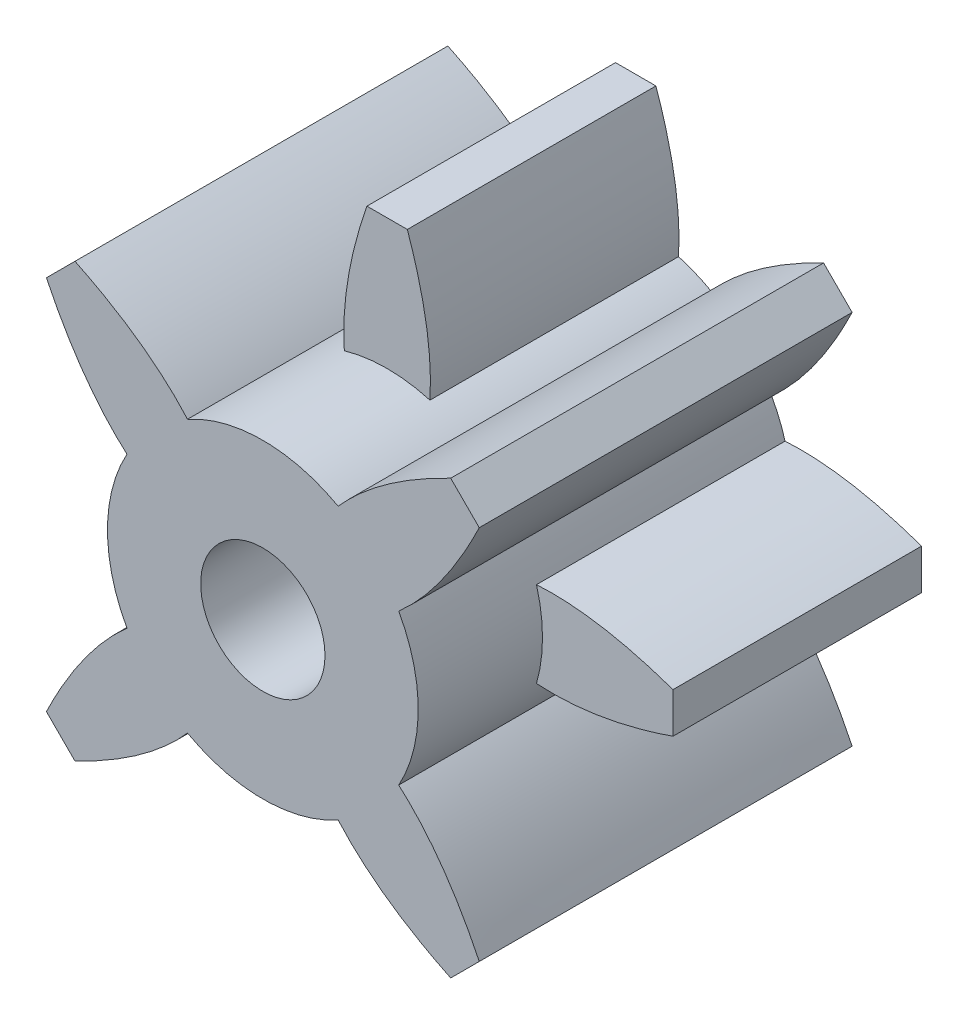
from build123d import *

# Parameters (mm, degrees)
EXTRUDE_1_DEPTH     = 30
EXTRUDE_1_2_DEPTH   = 30
EXTRUDE_1_3_DEPTH   = 30
EXTRUDE_1_4_DEPTH   = 30
EXTRUDE_1_5_DEPTH   = 30
EXTRUDE_1_6_DEPTH   = 30
EXTRUDE_1_7_DEPTH   = 30
EXTRUDE_1_8_DEPTH   = 30
SKETCH_4_R          = 12.5
SKETCH_4_R_2        = 5
EXTRUDE_2_DEPTH     = 30
CUT_EXTRUDE_1_DEPTH = 10


with BuildPart() as part:
    # Sketch 3 → Extrude 1 (new body)
    with BuildSketch(Plane.XY):
        with BuildLine():
            Line((-1.625, 40), (1.625, 40))
            add(Edge.make_bspline(
                [(1.625, 40), (3.171367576, 44.905035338), (3.445466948, 50.984228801)],
                knots=[0, 0, 0, 1, 1, 1], degree=2))
            ThreePointArc((3.445466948, 50.984228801), (0, 50.5), (-3.445466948, 50.984228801))
            add(Edge.make_bspline(
                [(-1.625, 40), (-3.171367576, 44.905035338), (-3.445466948, 50.984228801)],
                knots=[0, 0, 0, 1, 1, 1], degree=2))
        make_face()
    extrude(amount=-EXTRUDE_1_DEPTH)



with BuildPart() as body_2:
    # Sketch 3 → Extrude 1 2 (new body)
    with BuildSketch(Plane.XY):
        with BuildLine():
            Line((-17.412504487, 47.885592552), (-15.114407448, 45.587495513))
            add(Edge.make_bspline(
                [(-15.114407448, 45.587495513), (-9.294983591, 48.395541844), (-6.060120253, 52.067253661)],
                knots=[0, 0, 0, 1, 1, 1], degree=2))
            ThreePointArc((-6.060120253, 52.067253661), (-8.838834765, 54.161165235), (-10.932746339, 56.939879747))
            add(Edge.make_bspline(
                [(-17.412504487, 47.885592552), (-14.604458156, 53.705016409), (-10.932746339, 56.939879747)],
                knots=[0, 0, 0, 1, 1, 1], degree=2))
        make_face()
    extrude(amount=-EXTRUDE_1_2_DEPTH)


with BuildPart() as body_3:
    # Sketch 3 → Extrude 1 3 (new body)
    with BuildSketch(Plane.XY):
        with BuildLine():
            Line((-23, 64.625), (-23, 61.375))
            add(Edge.make_bspline(
                [(-23, 61.375), (-16.899457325, 59.24563453), (-12.015771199, 59.554533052)],
                knots=[0, 0, 0, 1, 1, 1], degree=2))
            ThreePointArc((-12.015771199, 59.554533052), (-12.5, 63), (-12.015771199, 66.445466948))
            add(Edge.make_bspline(
                [(-23, 64.625), (-16.899457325, 66.75436547), (-12.015771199, 66.445466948)],
                knots=[0, 0, 0, 1, 1, 1], degree=2))
        make_face()
    extrude(amount=-EXTRUDE_1_3_DEPTH)


with BuildPart() as body_4:
    # Sketch 3 → Extrude 1 4 (new body)
    with BuildSketch(Plane.XY):
        with BuildLine():
            Line((-15.114407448, 80.412504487), (-17.412504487, 78.114407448))
            add(Edge.make_bspline(
                [(-17.412504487, 78.114407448), (-14.604458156, 72.294983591), (-10.932746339, 69.060120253)],
                knots=[0, 0, 0, 1, 1, 1], degree=2))
            ThreePointArc((-10.932746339, 69.060120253), (-8.838834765, 71.838834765), (-6.060120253, 73.932746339))
            add(Edge.make_bspline(
                [(-15.114407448, 80.412504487), (-9.294983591, 77.604458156), (-6.060120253, 73.932746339)],
                knots=[0, 0, 0, 1, 1, 1], degree=2))
        make_face()
    extrude(amount=-EXTRUDE_1_4_DEPTH)


with BuildPart() as body_5:
    # Sketch 3 → Extrude 1 5 (new body)
    with BuildSketch(Plane.XY):
        with BuildLine():
            Line((1.625, 86), (-1.625, 86))
            add(Edge.make_bspline(
                [(-1.625, 86), (-3.75436547, 79.899457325), (-3.445466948, 75.015771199)],
                knots=[0, 0, 0, 1, 1, 1], degree=2))
            ThreePointArc((-3.445466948, 75.015771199), (0, 75.5), (3.445466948, 75.015771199))
            add(Edge.make_bspline(
                [(1.625, 86), (3.75436547, 79.899457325), (3.445466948, 75.015771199)],
                knots=[0, 0, 0, 1, 1, 1], degree=2))
        make_face()
    extrude(amount=-EXTRUDE_1_5_DEPTH)


with BuildPart() as body_6:
    # Sketch 3 → Extrude 1 6 (new body)
    with BuildSketch(Plane.XY):
        with BuildLine():
            Line((17.412504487, 78.114407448), (15.114407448, 80.412504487))
            add(Edge.make_bspline(
                [(15.114407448, 80.412504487), (9.294983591, 77.604458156), (6.060120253, 73.932746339)],
                knots=[0, 0, 0, 1, 1, 1], degree=2))
            ThreePointArc((6.060120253, 73.932746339), (8.838834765, 71.838834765), (10.932746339, 69.060120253))
            add(Edge.make_bspline(
                [(17.412504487, 78.114407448), (14.604458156, 72.294983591), (10.932746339, 69.060120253)],
                knots=[0, 0, 0, 1, 1, 1], degree=2))
        make_face()
    extrude(amount=-EXTRUDE_1_6_DEPTH)


with BuildPart() as body_7:
    # Sketch 3 → Extrude 1 7 (new body)
    with BuildSketch(Plane.XY):
        with BuildLine():
            Line((23, 61.375), (23, 64.625))
            add(Edge.make_bspline(
                [(23, 64.625), (16.899457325, 66.75436547), (12.015771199, 66.445466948)],
                knots=[0, 0, 0, 1, 1, 1], degree=2))
            ThreePointArc((12.015771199, 66.445466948), (12.5, 63), (12.015771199, 59.554533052))
            add(Edge.make_bspline(
                [(23, 61.375), (16.899457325, 59.24563453), (12.015771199, 59.554533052)],
                knots=[0, 0, 0, 1, 1, 1], degree=2))
        make_face()
    extrude(amount=-EXTRUDE_1_7_DEPTH)


with BuildPart() as body_8:
    # Sketch 3 → Extrude 1 8 (new body)
    with BuildSketch(Plane.XY):
        with BuildLine():
            Line((15.114407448, 45.587495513), (17.412504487, 47.885592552))
            add(Edge.make_bspline(
                [(17.412504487, 47.885592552), (14.604458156, 53.705016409), (10.932746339, 56.939879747)],
                knots=[0, 0, 0, 1, 1, 1], degree=2))
            ThreePointArc((10.932746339, 56.939879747), (8.838834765, 54.161165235), (6.060120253, 52.067253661))
            add(Edge.make_bspline(
                [(15.114407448, 45.587495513), (9.294983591, 48.395541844), (6.060120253, 52.067253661)],
                knots=[0, 0, 0, 1, 1, 1], degree=2))
        make_face()
    extrude(amount=-EXTRUDE_1_8_DEPTH)


with BuildPart() as part_1:
    add(part.part)

    add(body_2.part)  # Extrude 2 merges body 2

    add(body_3.part)  # Extrude 2 merges body 3

    add(body_4.part)  # Extrude 2 merges body 4

    add(body_5.part)  # Extrude 2 merges body 5

    add(body_6.part)  # Extrude 2 merges body 6

    add(body_7.part)  # Extrude 2 merges body 7

    add(body_8.part)  # Extrude 2 merges body 8
    # Sketch 4 → Extrude 2 (add)
    with BuildSketch(Plane.XY):
        with Locations((0, 63)):
            Circle(SKETCH_4_R)
        with Locations((0, 63)):
            Circle(SKETCH_4_R_2, mode=Mode.SUBTRACT)
    extrude(amount=-EXTRUDE_2_DEPTH)

    # Sketch 5 → Cut-Extrude 1 (cut)
    with BuildSketch(Plane.XY):
        with BuildLine():
            Line((-1.624999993, 39.999999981), (1.625, 40))
            add(Edge.make_bspline(
                [(1.625, 40), (3.171367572, 44.905035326), (3.44546695, 50.984228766)],
                knots=[0, 0, 0, 1, 1, 1], degree=2))
            ThreePointArc((3.44546695, 50.984228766), (-6e-09, 50.500000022), (-3.445466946, 50.984228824))
            add(Edge.make_bspline(
                [(-3.445466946, 50.984228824), (-3.171367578, 44.905035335), (-1.624999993, 39.999999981)],
                knots=[0, 0, 0, 1, 1, 1], degree=2))
        make_face()
        with BuildLine():
            Line((23.000000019, 61.375000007), (23, 64.625))
            add(Edge.make_bspline(
                [(23, 64.625), (16.899457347, 66.754365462), (12.015771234, 66.44546695)],
                knots=[0, 0, 0, 1, 1, 1], degree=2))
            ThreePointArc((12.015771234, 66.44546695), (12.5, 62.999999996), (12.015771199, 59.554533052))
            add(Edge.make_bspline(
                [(12.015771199, 59.554533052), (16.899457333, 59.24563453), (23.000000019, 61.375000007)],
                knots=[0, 0, 0, 1, 1, 1], degree=2))
        make_face()
        with BuildLine():
            Line((1.624999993, 86.000000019), (-1.625, 86))
            add(Edge.make_bspline(
                [(-1.625, 86), (-3.754365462, 79.899457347), (-3.44546695, 75.015771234)],
                knots=[0, 0, 0, 1, 1, 1], degree=2))
            ThreePointArc((-3.44546695, 75.015771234), (4e-09, 75.5), (3.445466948, 75.015771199))
            add(Edge.make_bspline(
                [(3.445466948, 75.015771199), (3.75436547, 79.899457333), (1.624999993, 86.000000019)],
                knots=[0, 0, 0, 1, 1, 1], degree=2))
        make_face()
        with BuildLine():
            Line((-23.000000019, 64.624999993), (-23, 61.375))
            add(Edge.make_bspline(
                [(-23, 61.375), (-16.899457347, 59.245634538), (-12.015771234, 59.55453305)],
                knots=[0, 0, 0, 1, 1, 1], degree=2))
            ThreePointArc((-12.015771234, 59.55453305), (-12.5, 63.000000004), (-12.015771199, 66.445466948))
            add(Edge.make_bspline(
                [(-12.015771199, 66.445466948), (-16.899457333, 66.75436547), (-23.000000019, 64.624999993)],
                knots=[0, 0, 0, 1, 1, 1], degree=2))
        make_face()
    extrude(amount=-CUT_EXTRUDE_1_DEPTH, mode=Mode.SUBTRACT)


solid = part_1.part
